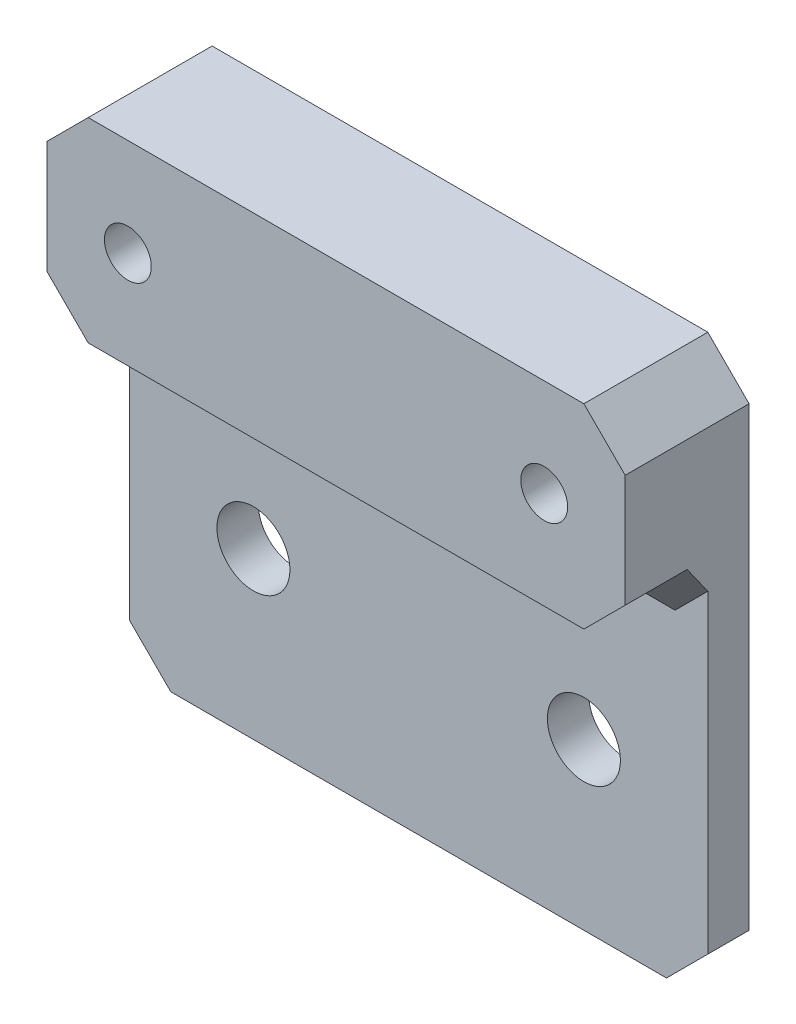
ISO-10303-21;
HEADER;
FILE_DESCRIPTION(('STEP AP214'),'2;1');
FILE_NAME('part.step','',(''),(''),'','','');
FILE_SCHEMA(('AUTOMOTIVE_DESIGN { 1 0 10303 214 1 1 1 1 }'));
ENDSEC;
DATA;
#1=APPLICATION_CONTEXT('core data for automotive mechanical design processes');
#2=APPLICATION_PROTOCOL_DEFINITION('international standard','automotive_design',2000,#1);
#3=PRODUCT_CONTEXT('',#1,'mechanical');
#4=PRODUCT('Part','Part','',(#3));
#5=PRODUCT_RELATED_PRODUCT_CATEGORY('part','',(#4));
#6=PRODUCT_DEFINITION_FORMATION('','',#4);
#7=PRODUCT_DEFINITION_CONTEXT('part definition',#1,'design');
#8=PRODUCT_DEFINITION('design','',#6,#7);
#9=PRODUCT_DEFINITION_SHAPE('','',#8);
#10=(LENGTH_UNIT() NAMED_UNIT(*) SI_UNIT(.MILLI.,.METRE.));
#11=(NAMED_UNIT(*) PLANE_ANGLE_UNIT() SI_UNIT($,.RADIAN.));
#12=(NAMED_UNIT(*) SI_UNIT($,.STERADIAN.) SOLID_ANGLE_UNIT());
#13=UNCERTAINTY_MEASURE_WITH_UNIT(LENGTH_MEASURE(1.E-05),#10,'distance_accuracy_value','');
#14=(GEOMETRIC_REPRESENTATION_CONTEXT(3) GLOBAL_UNCERTAINTY_ASSIGNED_CONTEXT((#13)) GLOBAL_UNIT_ASSIGNED_CONTEXT((#10,
#11,#12)) REPRESENTATION_CONTEXT('',''));
#15=CARTESIAN_POINT('',(0.,0.,0.));
#16=DIRECTION('',(0.,0.,1.));
#17=DIRECTION('',(1.,0.,0.));
#18=AXIS2_PLACEMENT_3D('',#15,#16,#17);
#19=CARTESIAN_POINT('',(22.225,28.7,3.175));
#20=DIRECTION('',(-1.,0.,0.));
#21=DIRECTION('',(0.,-1.,0.));
#22=AXIS2_PLACEMENT_3D('',#19,#20,#21);
#23=PLANE('',#22);
#24=DIRECTION('',(0.,1.,0.));
#25=VECTOR('',#24,1.);
#26=CARTESIAN_POINT('',(22.225,28.7,9.525));
#27=LINE('',#26,#25);
#28=CARTESIAN_POINT('',(22.225,16.875,9.525));
#29=VERTEX_POINT('',#28);
#30=CARTESIAN_POINT('',(22.225,25.525,9.525));
#31=VERTEX_POINT('',#30);
#32=EDGE_CURVE('E172',#29,#31,#27,.T.);
#33=ORIENTED_EDGE('',*,*,#32,.F.);
#34=DIRECTION('',(0.,0.,-1.));
#35=VECTOR('',#34,1.);
#36=CARTESIAN_POINT('',(22.225,16.875,3.175));
#37=LINE('',#36,#35);
#38=CARTESIAN_POINT('',(22.225,16.875,4.76250000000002));
#39=VERTEX_POINT('',#38);
#40=EDGE_CURVE('E182',#29,#39,#37,.T.);
#41=ORIENTED_EDGE('',*,*,#40,.T.);
#42=DIRECTION('',(0.,-0.816496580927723,-0.57735026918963));
#43=VECTOR('',#42,1.);
#44=CARTESIAN_POINT('',(22.225,24.0099786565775,9.80769179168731));
#45=LINE('',#44,#43);
#46=CARTESIAN_POINT('',(22.225,14.6299359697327,3.175));
#47=VERTEX_POINT('',#46);
#48=EDGE_CURVE('E44',#39,#47,#45,.T.);
#49=ORIENTED_EDGE('',*,*,#48,.T.);
#50=DIRECTION('',(0.,1.,0.));
#51=VECTOR('',#50,1.);
#52=CARTESIAN_POINT('',(22.225,12.7,3.175));
#53=LINE('',#52,#51);
#54=CARTESIAN_POINT('',(22.225,-9.525,3.175));
#55=VERTEX_POINT('',#54);
#56=EDGE_CURVE('E158',#55,#47,#53,.T.);
#57=ORIENTED_EDGE('',*,*,#56,.F.);
#58=DIRECTION('',(0.,0.,-1.));
#59=VECTOR('',#58,1.);
#60=CARTESIAN_POINT('',(22.225,-9.525,3.175));
#61=LINE('',#60,#59);
#62=CARTESIAN_POINT('',(22.225,-9.525,0.));
#63=VERTEX_POINT('',#62);
#64=EDGE_CURVE('E142',#55,#63,#61,.T.);
#65=ORIENTED_EDGE('',*,*,#64,.T.);
#66=DIRECTION('',(0.,1.,0.));
#67=VECTOR('',#66,1.);
#68=CARTESIAN_POINT('',(22.225,28.7,0.));
#69=LINE('',#68,#67);
#70=CARTESIAN_POINT('',(22.225,25.525,0.));
#71=VERTEX_POINT('',#70);
#72=EDGE_CURVE('E155',#63,#71,#69,.T.);
#73=ORIENTED_EDGE('',*,*,#72,.T.);
#74=DIRECTION('',(0.,0.,1.));
#75=VECTOR('',#74,1.);
#76=CARTESIAN_POINT('',(22.225,25.525,3.175));
#77=LINE('',#76,#75);
#78=EDGE_CURVE('E159',#71,#31,#77,.T.);
#79=ORIENTED_EDGE('',*,*,#78,.T.);
#80=EDGE_LOOP('',(#33,#41,#49,#57,#65,#73,#79));
#81=FACE_BOUND('',#80,.T.);
#82=ADVANCED_FACE('F35',(#81),#23,.F.);
#83=CARTESIAN_POINT('',(-22.225,28.7,3.175));
#84=DIRECTION('',(0.,-1.,0.));
#85=DIRECTION('',(0.,0.,-1.));
#86=AXIS2_PLACEMENT_3D('',#83,#84,#85);
#87=PLANE('',#86);
#88=DIRECTION('',(-1.,0.,0.));
#89=VECTOR('',#88,1.);
#90=CARTESIAN_POINT('',(-22.225,28.7,0.));
#91=LINE('',#90,#89);
#92=CARTESIAN_POINT('',(19.05,28.7,0.));
#93=VERTEX_POINT('',#92);
#94=CARTESIAN_POINT('',(-19.05,28.7,0.));
#95=VERTEX_POINT('',#94);
#96=EDGE_CURVE('E165',#93,#95,#91,.T.);
#97=ORIENTED_EDGE('',*,*,#96,.T.);
#98=DIRECTION('',(0.,0.,1.));
#99=VECTOR('',#98,1.);
#100=CARTESIAN_POINT('',(-19.05,28.7,3.175));
#101=LINE('',#100,#99);
#102=CARTESIAN_POINT('',(-19.05,28.7,9.525));
#103=VERTEX_POINT('',#102);
#104=EDGE_CURVE('E212',#95,#103,#101,.T.);
#105=ORIENTED_EDGE('',*,*,#104,.T.);
#106=DIRECTION('',(-1.,0.,0.));
#107=VECTOR('',#106,1.);
#108=CARTESIAN_POINT('',(-22.225,28.7,9.525));
#109=LINE('',#108,#107);
#110=CARTESIAN_POINT('',(19.05,28.7,9.525));
#111=VERTEX_POINT('',#110);
#112=EDGE_CURVE('E166',#111,#103,#109,.T.);
#113=ORIENTED_EDGE('',*,*,#112,.F.);
#114=DIRECTION('',(0.,0.,-1.));
#115=VECTOR('',#114,1.);
#116=CARTESIAN_POINT('',(19.05,28.7,3.175));
#117=LINE('',#116,#115);
#118=EDGE_CURVE('E209',#111,#93,#117,.T.);
#119=ORIENTED_EDGE('',*,*,#118,.T.);
#120=EDGE_LOOP('',(#97,#105,#113,#119));
#121=FACE_BOUND('',#120,.T.);
#122=ADVANCED_FACE('F305',(#121),#87,.F.);
#123=CARTESIAN_POINT('',(-22.225,12.7,3.175));
#124=DIRECTION('',(1.,0.,0.));
#125=DIRECTION('',(0.,1.,0.));
#126=AXIS2_PLACEMENT_3D('',#123,#124,#125);
#127=PLANE('',#126);
#128=DIRECTION('',(0.,-1.,0.));
#129=VECTOR('',#128,1.);
#130=CARTESIAN_POINT('',(-22.225,13.7,3.175));
#131=LINE('',#130,#129);
#132=CARTESIAN_POINT('',(-22.225,14.6299359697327,3.175));
#133=VERTEX_POINT('',#132);
#134=CARTESIAN_POINT('',(-22.225,-9.525,3.175));
#135=VERTEX_POINT('',#134);
#136=EDGE_CURVE('E285',#133,#135,#131,.T.);
#137=ORIENTED_EDGE('',*,*,#136,.F.);
#138=DIRECTION('',(0.,0.816496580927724,0.577350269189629));
#139=VECTOR('',#138,1.);
#140=CARTESIAN_POINT('',(-22.225,13.3433119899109,2.26521945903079));
#141=LINE('',#140,#139);
#142=CARTESIAN_POINT('',(-22.225,16.875,4.76250000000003));
#143=VERTEX_POINT('',#142);
#144=EDGE_CURVE('E11',#133,#143,#141,.T.);
#145=ORIENTED_EDGE('',*,*,#144,.T.);
#146=DIRECTION('',(0.,0.,1.));
#147=VECTOR('',#146,1.);
#148=CARTESIAN_POINT('',(-22.225,16.875,3.175));
#149=LINE('',#148,#147);
#150=CARTESIAN_POINT('',(-22.225,16.875,9.525));
#151=VERTEX_POINT('',#150);
#152=EDGE_CURVE('E203',#143,#151,#149,.T.);
#153=ORIENTED_EDGE('',*,*,#152,.T.);
#154=DIRECTION('',(0.,-1.,0.));
#155=VECTOR('',#154,1.);
#156=CARTESIAN_POINT('',(-22.225,28.7,9.525));
#157=LINE('',#156,#155);
#158=CARTESIAN_POINT('',(-22.225,25.525,9.525));
#159=VERTEX_POINT('',#158);
#160=EDGE_CURVE('E277',#159,#151,#157,.T.);
#161=ORIENTED_EDGE('',*,*,#160,.F.);
#162=DIRECTION('',(0.,0.,-1.));
#163=VECTOR('',#162,1.);
#164=CARTESIAN_POINT('',(-22.225,25.525,3.175));
#165=LINE('',#164,#163);
#166=CARTESIAN_POINT('',(-22.225,25.525,0.));
#167=VERTEX_POINT('',#166);
#168=EDGE_CURVE('E200',#159,#167,#165,.T.);
#169=ORIENTED_EDGE('',*,*,#168,.T.);
#170=DIRECTION('',(0.,-1.,0.));
#171=VECTOR('',#170,1.);
#172=CARTESIAN_POINT('',(-22.225,12.7,0.));
#173=LINE('',#172,#171);
#174=CARTESIAN_POINT('',(-22.225,-9.525,0.));
#175=VERTEX_POINT('',#174);
#176=EDGE_CURVE('E169',#167,#175,#173,.T.);
#177=ORIENTED_EDGE('',*,*,#176,.T.);
#178=DIRECTION('',(0.,0.,1.));
#179=VECTOR('',#178,1.);
#180=CARTESIAN_POINT('',(-22.225,-9.525,3.175));
#181=LINE('',#180,#179);
#182=EDGE_CURVE('E197',#175,#135,#181,.T.);
#183=ORIENTED_EDGE('',*,*,#182,.T.);
#184=EDGE_LOOP('',(#137,#145,#153,#161,#169,#177,#183));
#185=FACE_BOUND('',#184,.T.);
#186=ADVANCED_FACE('F297',(#185),#127,.F.);
#187=CARTESIAN_POINT('',(-22.225,-12.7,3.175));
#188=DIRECTION('',(0.,1.,0.));
#189=DIRECTION('',(0.,0.,1.));
#190=AXIS2_PLACEMENT_3D('',#187,#188,#189);
#191=PLANE('',#190);
#192=DIRECTION('',(1.,0.,0.));
#193=VECTOR('',#192,1.);
#194=CARTESIAN_POINT('',(-22.225,-12.7,0.));
#195=LINE('',#194,#193);
#196=CARTESIAN_POINT('',(-19.05,-12.7,0.));
#197=VERTEX_POINT('',#196);
#198=CARTESIAN_POINT('',(19.05,-12.7,0.));
#199=VERTEX_POINT('',#198);
#200=EDGE_CURVE('E179',#197,#199,#195,.T.);
#201=ORIENTED_EDGE('',*,*,#200,.T.);
#202=DIRECTION('',(0.,0.,1.));
#203=VECTOR('',#202,1.);
#204=CARTESIAN_POINT('',(19.05,-12.7,3.175));
#205=LINE('',#204,#203);
#206=CARTESIAN_POINT('',(19.05,-12.7,3.175));
#207=VERTEX_POINT('',#206);
#208=EDGE_CURVE('E143',#199,#207,#205,.T.);
#209=ORIENTED_EDGE('',*,*,#208,.T.);
#210=DIRECTION('',(1.,0.,0.));
#211=VECTOR('',#210,1.);
#212=CARTESIAN_POINT('',(-22.225,-12.7,3.175));
#213=LINE('',#212,#211);
#214=CARTESIAN_POINT('',(-19.05,-12.7,3.175));
#215=VERTEX_POINT('',#214);
#216=EDGE_CURVE('E160',#215,#207,#213,.T.);
#217=ORIENTED_EDGE('',*,*,#216,.F.);
#218=DIRECTION('',(0.,0.,-1.));
#219=VECTOR('',#218,1.);
#220=CARTESIAN_POINT('',(-19.05,-12.7,3.175));
#221=LINE('',#220,#219);
#222=EDGE_CURVE('E214',#215,#197,#221,.T.);
#223=ORIENTED_EDGE('',*,*,#222,.T.);
#224=EDGE_LOOP('',(#201,#209,#217,#223));
#225=FACE_BOUND('',#224,.T.);
#226=ADVANCED_FACE('F293',(#225),#191,.F.);
#227=CARTESIAN_POINT('',(0.,0.,3.175));
#228=DIRECTION('',(0.,0.,1.));
#229=DIRECTION('',(1.,0.,0.));
#230=AXIS2_PLACEMENT_3D('',#227,#228,#229);
#231=PLANE('',#230);
#232=CARTESIAN_POINT('',(-12.7,0.,3.175));
#233=DIRECTION('',(0.,0.,1.));
#234=DIRECTION('',(1.,0.,0.));
#235=AXIS2_PLACEMENT_3D('',#232,#233,#234);
#236=CIRCLE('',#235,2.8067);
#237=CARTESIAN_POINT('',(-9.89330000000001,0.,3.175));
#238=VERTEX_POINT('',#237);
#239=EDGE_CURVE('E399',#238,#238,#236,.T.);
#240=ORIENTED_EDGE('',*,*,#239,.F.);
#241=EDGE_LOOP('',(#240));
#242=FACE_BOUND('',#241,.T.);
#243=CARTESIAN_POINT('',(12.7,0.,3.175));
#244=DIRECTION('',(0.,0.,1.));
#245=DIRECTION('',(1.,0.,0.));
#246=AXIS2_PLACEMENT_3D('',#243,#244,#245);
#247=CIRCLE('',#246,2.8067);
#248=CARTESIAN_POINT('',(15.5067,0.,3.175));
#249=VERTEX_POINT('',#248);
#250=EDGE_CURVE('E244',#249,#249,#247,.T.);
#251=ORIENTED_EDGE('',*,*,#250,.F.);
#252=EDGE_LOOP('',(#251));
#253=FACE_BOUND('',#252,.T.);
#254=ORIENTED_EDGE('',*,*,#56,.T.);
#255=DIRECTION('',(-0.707106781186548,-0.707106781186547,0.));
#256=VECTOR('',#255,1.);
#257=CARTESIAN_POINT('',(20.1725320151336,12.5774679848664,3.175));
#258=LINE('',#257,#256);
#259=CARTESIAN_POINT('',(19.7075640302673,12.1125,3.175));
#260=VERTEX_POINT('',#259);
#261=EDGE_CURVE('E226',#47,#260,#258,.T.);
#262=ORIENTED_EDGE('',*,*,#261,.T.);
#263=DIRECTION('',(-1.,0.,0.));
#264=VECTOR('',#263,1.);
#265=CARTESIAN_POINT('',(0.,12.1125,3.175));
#266=LINE('',#265,#264);
#267=CARTESIAN_POINT('',(-19.7075640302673,12.1125,3.175));
#268=VERTEX_POINT('',#267);
#269=EDGE_CURVE('E222',#260,#268,#266,.T.);
#270=ORIENTED_EDGE('',*,*,#269,.T.);
#271=DIRECTION('',(-0.707106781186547,0.707106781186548,0.));
#272=VECTOR('',#271,1.);
#273=CARTESIAN_POINT('',(-23.3475320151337,15.7524679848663,3.175));
#274=LINE('',#273,#272);
#275=EDGE_CURVE('E224',#268,#133,#274,.T.);
#276=ORIENTED_EDGE('',*,*,#275,.T.);
#277=ORIENTED_EDGE('',*,*,#136,.T.);
#278=DIRECTION('',(-0.707106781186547,0.707106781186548,0.));
#279=VECTOR('',#278,1.);
#280=CARTESIAN_POINT('',(-15.875,-15.875,3.175));
#281=LINE('',#280,#279);
#282=EDGE_CURVE('E218',#135,#215,#281,.F.);
#283=ORIENTED_EDGE('',*,*,#282,.T.);
#284=ORIENTED_EDGE('',*,*,#216,.T.);
#285=DIRECTION('',(-0.707106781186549,-0.707106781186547,0.));
#286=VECTOR('',#285,1.);
#287=CARTESIAN_POINT('',(15.875,-15.875,3.175));
#288=LINE('',#287,#286);
#289=EDGE_CURVE('E220',#207,#55,#288,.F.);
#290=ORIENTED_EDGE('',*,*,#289,.T.);
#291=EDGE_LOOP('',(#254,#262,#270,#276,#277,#283,#284,#290));
#292=FACE_BOUND('',#291,.T.);
#293=ADVANCED_FACE('F289',(#242,#253,#292),#231,.T.);
#294=CARTESIAN_POINT('',(0.,0.,0.));
#295=DIRECTION('',(0.,0.,1.));
#296=DIRECTION('',(1.,0.,0.));
#297=AXIS2_PLACEMENT_3D('',#294,#295,#296);
#298=PLANE('',#297);
#299=CARTESIAN_POINT('',(-12.7,0.,0.));
#300=DIRECTION('',(0.,0.,1.));
#301=DIRECTION('',(1.,0.,0.));
#302=AXIS2_PLACEMENT_3D('',#299,#300,#301);
#303=CIRCLE('',#302,2.8067);
#304=CARTESIAN_POINT('',(-9.89330000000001,0.,0.));
#305=VERTEX_POINT('',#304);
#306=EDGE_CURVE('E249',#305,#305,#303,.T.);
#307=ORIENTED_EDGE('',*,*,#306,.T.);
#308=EDGE_LOOP('',(#307));
#309=FACE_BOUND('',#308,.T.);
#310=CARTESIAN_POINT('',(12.7,0.,0.));
#311=DIRECTION('',(0.,0.,1.));
#312=DIRECTION('',(1.,0.,0.));
#313=AXIS2_PLACEMENT_3D('',#310,#311,#312);
#314=CIRCLE('',#313,2.8067);
#315=CARTESIAN_POINT('',(15.5067,0.,0.));
#316=VERTEX_POINT('',#315);
#317=EDGE_CURVE('E235',#316,#316,#314,.T.);
#318=ORIENTED_EDGE('',*,*,#317,.T.);
#319=EDGE_LOOP('',(#318));
#320=FACE_BOUND('',#319,.T.);
#321=CARTESIAN_POINT('',(16.,21.2,0.));
#322=DIRECTION('',(0.,0.,-1.));
#323=DIRECTION('',(-1.,0.,0.));
#324=AXIS2_PLACEMENT_3D('',#321,#322,#323);
#325=CIRCLE('',#324,4.2);
#326=CARTESIAN_POINT('',(11.8,21.2,0.));
#327=VERTEX_POINT('',#326);
#328=EDGE_CURVE('E242',#327,#327,#325,.T.);
#329=ORIENTED_EDGE('',*,*,#328,.F.);
#330=EDGE_LOOP('',(#329));
#331=FACE_BOUND('',#330,.T.);
#332=CARTESIAN_POINT('',(-16.,21.2,0.));
#333=DIRECTION('',(0.,0.,-1.));
#334=DIRECTION('',(-1.,0.,0.));
#335=AXIS2_PLACEMENT_3D('',#332,#333,#334);
#336=CIRCLE('',#335,4.2);
#337=CARTESIAN_POINT('',(-20.2,21.2,0.));
#338=VERTEX_POINT('',#337);
#339=EDGE_CURVE('E264',#338,#338,#336,.T.);
#340=ORIENTED_EDGE('',*,*,#339,.F.);
#341=EDGE_LOOP('',(#340));
#342=FACE_BOUND('',#341,.T.);
#343=ORIENTED_EDGE('',*,*,#176,.F.);
#344=DIRECTION('',(-0.707106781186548,-0.707106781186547,0.));
#345=VECTOR('',#344,1.);
#346=CARTESIAN_POINT('',(-22.225,25.525,0.));
#347=LINE('',#346,#345);
#348=EDGE_CURVE('E207',#167,#95,#347,.F.);
#349=ORIENTED_EDGE('',*,*,#348,.T.);
#350=ORIENTED_EDGE('',*,*,#96,.F.);
#351=DIRECTION('',(-0.707106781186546,0.707106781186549,0.));
#352=VECTOR('',#351,1.);
#353=CARTESIAN_POINT('',(19.05,28.7,0.));
#354=LINE('',#353,#352);
#355=EDGE_CURVE('E148',#93,#71,#354,.F.);
#356=ORIENTED_EDGE('',*,*,#355,.T.);
#357=ORIENTED_EDGE('',*,*,#72,.F.);
#358=DIRECTION('',(0.707106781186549,0.707106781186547,0.));
#359=VECTOR('',#358,1.);
#360=CARTESIAN_POINT('',(22.225,-9.525,0.));
#361=LINE('',#360,#359);
#362=EDGE_CURVE('E138',#63,#199,#361,.F.);
#363=ORIENTED_EDGE('',*,*,#362,.T.);
#364=ORIENTED_EDGE('',*,*,#200,.F.);
#365=DIRECTION('',(0.707106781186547,-0.707106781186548,0.));
#366=VECTOR('',#365,1.);
#367=CARTESIAN_POINT('',(-19.05,-12.7,0.));
#368=LINE('',#367,#366);
#369=EDGE_CURVE('E149',#197,#175,#368,.F.);
#370=ORIENTED_EDGE('',*,*,#369,.T.);
#371=EDGE_LOOP('',(#343,#349,#350,#356,#357,#363,#364,#370));
#372=FACE_BOUND('',#371,.T.);
#373=ADVANCED_FACE('F163',(#309,#320,#331,#342,#372),#298,.F.);
#374=CARTESIAN_POINT('',(-22.225,13.7,9.525));
#375=DIRECTION('',(0.,1.,0.));
#376=DIRECTION('',(0.,0.,1.));
#377=AXIS2_PLACEMENT_3D('',#374,#375,#376);
#378=PLANE('',#377);
#379=DIRECTION('',(0.,0.,-1.));
#380=VECTOR('',#379,1.);
#381=CARTESIAN_POINT('',(-19.05,13.7,9.525));
#382=LINE('',#381,#380);
#383=CARTESIAN_POINT('',(-19.05,13.7,9.525));
#384=VERTEX_POINT('',#383);
#385=CARTESIAN_POINT('',(-19.05,13.7,4.76250000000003));
#386=VERTEX_POINT('',#385);
#387=EDGE_CURVE('E185',#384,#386,#382,.T.);
#388=ORIENTED_EDGE('',*,*,#387,.T.);
#389=DIRECTION('',(1.,0.,0.));
#390=VECTOR('',#389,1.);
#391=CARTESIAN_POINT('',(-22.225,13.7,4.76250000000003));
#392=LINE('',#391,#390);
#393=CARTESIAN_POINT('',(19.05,13.7,4.76250000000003));
#394=VERTEX_POINT('',#393);
#395=EDGE_CURVE('E232',#386,#394,#392,.T.);
#396=ORIENTED_EDGE('',*,*,#395,.T.);
#397=DIRECTION('',(0.,0.,1.));
#398=VECTOR('',#397,1.);
#399=CARTESIAN_POINT('',(19.05,13.7,9.525));
#400=LINE('',#399,#398);
#401=CARTESIAN_POINT('',(19.05,13.7,9.525));
#402=VERTEX_POINT('',#401);
#403=EDGE_CURVE('E187',#394,#402,#400,.T.);
#404=ORIENTED_EDGE('',*,*,#403,.T.);
#405=DIRECTION('',(1.,0.,0.));
#406=VECTOR('',#405,1.);
#407=CARTESIAN_POINT('',(-22.225,13.7,9.525));
#408=LINE('',#407,#406);
#409=EDGE_CURVE('E280',#384,#402,#408,.T.);
#410=ORIENTED_EDGE('',*,*,#409,.F.);
#411=EDGE_LOOP('',(#388,#396,#404,#410));
#412=FACE_BOUND('',#411,.T.);
#413=ADVANCED_FACE('F328',(#412),#378,.F.);
#414=CARTESIAN_POINT('',(0.,0.,9.525));
#415=DIRECTION('',(0.,0.,1.));
#416=DIRECTION('',(1.,0.,0.));
#417=AXIS2_PLACEMENT_3D('',#414,#415,#416);
#418=PLANE('',#417);
#419=CARTESIAN_POINT('',(16.,21.2,9.525));
#420=DIRECTION('',(0.,0.,-1.));
#421=DIRECTION('',(-1.,0.,0.));
#422=AXIS2_PLACEMENT_3D('',#419,#420,#421);
#423=CIRCLE('',#422,1.8);
#424=CARTESIAN_POINT('',(14.2,21.2,9.525));
#425=VERTEX_POINT('',#424);
#426=EDGE_CURVE('E261',#425,#425,#423,.T.);
#427=ORIENTED_EDGE('',*,*,#426,.T.);
#428=EDGE_LOOP('',(#427));
#429=FACE_BOUND('',#428,.T.);
#430=CARTESIAN_POINT('',(-16.,21.2,9.525));
#431=DIRECTION('',(0.,0.,-1.));
#432=DIRECTION('',(-1.,0.,0.));
#433=AXIS2_PLACEMENT_3D('',#430,#431,#432);
#434=CIRCLE('',#433,1.8);
#435=CARTESIAN_POINT('',(-17.8,21.2,9.525));
#436=VERTEX_POINT('',#435);
#437=EDGE_CURVE('E274',#436,#436,#434,.T.);
#438=ORIENTED_EDGE('',*,*,#437,.T.);
#439=EDGE_LOOP('',(#438));
#440=FACE_BOUND('',#439,.T.);
#441=ORIENTED_EDGE('',*,*,#409,.T.);
#442=DIRECTION('',(-0.707106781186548,-0.707106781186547,0.));
#443=VECTOR('',#442,1.);
#444=CARTESIAN_POINT('',(2.67499999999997,-2.67499999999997,9.525));
#445=LINE('',#444,#443);
#446=EDGE_CURVE('E195',#402,#29,#445,.F.);
#447=ORIENTED_EDGE('',*,*,#446,.T.);
#448=ORIENTED_EDGE('',*,*,#32,.T.);
#449=DIRECTION('',(0.707106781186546,-0.707106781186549,0.));
#450=VECTOR('',#449,1.);
#451=CARTESIAN_POINT('',(23.875,23.8749999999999,9.525));
#452=LINE('',#451,#450);
#453=EDGE_CURVE('E189',#31,#111,#452,.F.);
#454=ORIENTED_EDGE('',*,*,#453,.T.);
#455=ORIENTED_EDGE('',*,*,#112,.T.);
#456=DIRECTION('',(0.707106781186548,0.707106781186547,0.));
#457=VECTOR('',#456,1.);
#458=CARTESIAN_POINT('',(-23.875,23.875,9.525));
#459=LINE('',#458,#457);
#460=EDGE_CURVE('E191',#103,#159,#459,.F.);
#461=ORIENTED_EDGE('',*,*,#460,.T.);
#462=ORIENTED_EDGE('',*,*,#160,.T.);
#463=DIRECTION('',(-0.707106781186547,0.707106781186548,0.));
#464=VECTOR('',#463,1.);
#465=CARTESIAN_POINT('',(-2.67500000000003,-2.67500000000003,9.525));
#466=LINE('',#465,#464);
#467=EDGE_CURVE('E193',#151,#384,#466,.F.);
#468=ORIENTED_EDGE('',*,*,#467,.T.);
#469=EDGE_LOOP('',(#441,#447,#448,#454,#455,#461,#462,#468));
#470=FACE_BOUND('',#469,.T.);
#471=ADVANCED_FACE('F313',(#429,#440,#470),#418,.T.);
#472=CARTESIAN_POINT('',(-16.,21.2,0.));
#473=DIRECTION('',(0.,0.,-1.));
#474=DIRECTION('',(-1.,0.,0.));
#475=AXIS2_PLACEMENT_3D('',#472,#473,#474);
#476=CYLINDRICAL_SURFACE('',#475,1.8);
#477=ORIENTED_EDGE('',*,*,#437,.F.);
#478=EDGE_LOOP('',(#477));
#479=FACE_BOUND('',#478,.T.);
#480=CARTESIAN_POINT('',(-16.,21.2,2.3));
#481=DIRECTION('',(0.,0.,-1.));
#482=DIRECTION('',(-1.,0.,0.));
#483=AXIS2_PLACEMENT_3D('',#480,#481,#482);
#484=CIRCLE('',#483,1.8);
#485=CARTESIAN_POINT('',(-17.8,21.2,2.3));
#486=VERTEX_POINT('',#485);
#487=EDGE_CURVE('E271',#486,#486,#484,.T.);
#488=ORIENTED_EDGE('',*,*,#487,.T.);
#489=EDGE_LOOP('',(#488));
#490=FACE_BOUND('',#489,.T.);
#491=ADVANCED_FACE('F361',(#479,#490),#476,.F.);
#492=CARTESIAN_POINT('',(-14.2,21.2,2.3));
#493=DIRECTION('',(0.,0.,1.));
#494=DIRECTION('',(1.,0.,0.));
#495=AXIS2_PLACEMENT_3D('',#492,#493,#494);
#496=PLANE('',#495);
#497=ORIENTED_EDGE('',*,*,#487,.F.);
#498=EDGE_LOOP('',(#497));
#499=FACE_BOUND('',#498,.T.);
#500=CARTESIAN_POINT('',(-16.,21.2,2.3));
#501=DIRECTION('',(0.,0.,-1.));
#502=DIRECTION('',(-1.,0.,0.));
#503=AXIS2_PLACEMENT_3D('',#500,#501,#502);
#504=CIRCLE('',#503,4.2);
#505=CARTESIAN_POINT('',(-20.2,21.2,2.3));
#506=VERTEX_POINT('',#505);
#507=EDGE_CURVE('E268',#506,#506,#504,.T.);
#508=ORIENTED_EDGE('',*,*,#507,.T.);
#509=EDGE_LOOP('',(#508));
#510=FACE_BOUND('',#509,.T.);
#511=ADVANCED_FACE('F365',(#499,#510),#496,.F.);
#512=CARTESIAN_POINT('',(-16.,21.2,0.));
#513=DIRECTION('',(0.,0.,-1.));
#514=DIRECTION('',(-1.,0.,0.));
#515=AXIS2_PLACEMENT_3D('',#512,#513,#514);
#516=CYLINDRICAL_SURFACE('',#515,4.2);
#517=ORIENTED_EDGE('',*,*,#507,.F.);
#518=EDGE_LOOP('',(#517));
#519=FACE_BOUND('',#518,.T.);
#520=ORIENTED_EDGE('',*,*,#339,.T.);
#521=EDGE_LOOP('',(#520));
#522=FACE_BOUND('',#521,.T.);
#523=ADVANCED_FACE('F369',(#519,#522),#516,.F.);
#524=CARTESIAN_POINT('',(16.,21.2,0.));
#525=DIRECTION('',(0.,0.,-1.));
#526=DIRECTION('',(-1.,0.,0.));
#527=AXIS2_PLACEMENT_3D('',#524,#525,#526);
#528=CYLINDRICAL_SURFACE('',#527,1.8);
#529=ORIENTED_EDGE('',*,*,#426,.F.);
#530=EDGE_LOOP('',(#529));
#531=FACE_BOUND('',#530,.T.);
#532=CARTESIAN_POINT('',(16.,21.2,2.3));
#533=DIRECTION('',(0.,0.,-1.));
#534=DIRECTION('',(-1.,0.,0.));
#535=AXIS2_PLACEMENT_3D('',#532,#533,#534);
#536=CIRCLE('',#535,1.8);
#537=CARTESIAN_POINT('',(14.2,21.2,2.3));
#538=VERTEX_POINT('',#537);
#539=EDGE_CURVE('E258',#538,#538,#536,.T.);
#540=ORIENTED_EDGE('',*,*,#539,.T.);
#541=EDGE_LOOP('',(#540));
#542=FACE_BOUND('',#541,.T.);
#543=ADVANCED_FACE('F373',(#531,#542),#528,.F.);
#544=CARTESIAN_POINT('',(17.8,21.2,2.3));
#545=DIRECTION('',(0.,0.,1.));
#546=DIRECTION('',(1.,0.,0.));
#547=AXIS2_PLACEMENT_3D('',#544,#545,#546);
#548=PLANE('',#547);
#549=ORIENTED_EDGE('',*,*,#539,.F.);
#550=EDGE_LOOP('',(#549));
#551=FACE_BOUND('',#550,.T.);
#552=CARTESIAN_POINT('',(16.,21.2,2.3));
#553=DIRECTION('',(0.,0.,-1.));
#554=DIRECTION('',(-1.,0.,0.));
#555=AXIS2_PLACEMENT_3D('',#552,#553,#554);
#556=CIRCLE('',#555,4.2);
#557=CARTESIAN_POINT('',(11.8,21.2,2.3));
#558=VERTEX_POINT('',#557);
#559=EDGE_CURVE('E255',#558,#558,#556,.T.);
#560=ORIENTED_EDGE('',*,*,#559,.T.);
#561=EDGE_LOOP('',(#560));
#562=FACE_BOUND('',#561,.T.);
#563=ADVANCED_FACE('F377',(#551,#562),#548,.F.);
#564=CARTESIAN_POINT('',(16.,21.2,0.));
#565=DIRECTION('',(0.,0.,-1.));
#566=DIRECTION('',(-1.,0.,0.));
#567=AXIS2_PLACEMENT_3D('',#564,#565,#566);
#568=CYLINDRICAL_SURFACE('',#567,4.2);
#569=ORIENTED_EDGE('',*,*,#559,.F.);
#570=EDGE_LOOP('',(#569));
#571=FACE_BOUND('',#570,.T.);
#572=ORIENTED_EDGE('',*,*,#328,.T.);
#573=EDGE_LOOP('',(#572));
#574=FACE_BOUND('',#573,.T.);
#575=ADVANCED_FACE('F338',(#571,#574),#568,.F.);
#576=CARTESIAN_POINT('',(22.225,16.875,3.175));
#577=DIRECTION('',(-0.707106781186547,0.707106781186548,0.));
#578=DIRECTION('',(0.,0.,-1.));
#579=AXIS2_PLACEMENT_3D('',#576,#577,#578);
#580=PLANE('',#579);
#581=ORIENTED_EDGE('',*,*,#403,.F.);
#582=DIRECTION('',(-0.707106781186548,-0.707106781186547,0.));
#583=VECTOR('',#582,1.);
#584=CARTESIAN_POINT('',(22.225,16.875,4.76250000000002));
#585=LINE('',#584,#583);
#586=EDGE_CURVE('E229',#394,#39,#585,.F.);
#587=ORIENTED_EDGE('',*,*,#586,.T.);
#588=ORIENTED_EDGE('',*,*,#40,.F.);
#589=ORIENTED_EDGE('',*,*,#446,.F.);
#590=EDGE_LOOP('',(#581,#587,#588,#589));
#591=FACE_BOUND('',#590,.T.);
#592=ADVANCED_FACE('F318',(#591),#580,.F.);
#593=CARTESIAN_POINT('',(-19.05,13.7,9.525));
#594=DIRECTION('',(0.707106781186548,0.707106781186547,0.));
#595=DIRECTION('',(0.,0.,-1.));
#596=AXIS2_PLACEMENT_3D('',#593,#594,#595);
#597=PLANE('',#596);
#598=ORIENTED_EDGE('',*,*,#152,.F.);
#599=DIRECTION('',(-0.707106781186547,0.707106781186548,0.));
#600=VECTOR('',#599,1.);
#601=CARTESIAN_POINT('',(-19.05,13.7,4.76250000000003));
#602=LINE('',#601,#600);
#603=EDGE_CURVE('E52',#143,#386,#602,.F.);
#604=ORIENTED_EDGE('',*,*,#603,.T.);
#605=ORIENTED_EDGE('',*,*,#387,.F.);
#606=ORIENTED_EDGE('',*,*,#467,.F.);
#607=EDGE_LOOP('',(#598,#604,#605,#606));
#608=FACE_BOUND('',#607,.T.);
#609=ADVANCED_FACE('F330',(#608),#597,.F.);
#610=CARTESIAN_POINT('',(-22.225,25.525,3.175));
#611=DIRECTION('',(0.707106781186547,-0.707106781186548,0.));
#612=DIRECTION('',(0.,0.,-1.));
#613=AXIS2_PLACEMENT_3D('',#610,#611,#612);
#614=PLANE('',#613);
#615=ORIENTED_EDGE('',*,*,#460,.F.);
#616=ORIENTED_EDGE('',*,*,#104,.F.);
#617=ORIENTED_EDGE('',*,*,#348,.F.);
#618=ORIENTED_EDGE('',*,*,#168,.F.);
#619=EDGE_LOOP('',(#615,#616,#617,#618));
#620=FACE_BOUND('',#619,.T.);
#621=ADVANCED_FACE('F302',(#620),#614,.F.);
#622=CARTESIAN_POINT('',(19.05,28.7,3.175));
#623=DIRECTION('',(-0.707106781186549,-0.707106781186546,0.));
#624=DIRECTION('',(0.,0.,-1.));
#625=AXIS2_PLACEMENT_3D('',#622,#623,#624);
#626=PLANE('',#625);
#627=ORIENTED_EDGE('',*,*,#453,.F.);
#628=ORIENTED_EDGE('',*,*,#78,.F.);
#629=ORIENTED_EDGE('',*,*,#355,.F.);
#630=ORIENTED_EDGE('',*,*,#118,.F.);
#631=EDGE_LOOP('',(#627,#628,#629,#630));
#632=FACE_BOUND('',#631,.T.);
#633=ADVANCED_FACE('F310',(#632),#626,.F.);
#634=CARTESIAN_POINT('',(22.225,-9.525,3.175));
#635=DIRECTION('',(-0.707106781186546,0.707106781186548,0.));
#636=DIRECTION('',(0.,0.,-1.));
#637=AXIS2_PLACEMENT_3D('',#634,#635,#636);
#638=PLANE('',#637);
#639=ORIENTED_EDGE('',*,*,#289,.F.);
#640=ORIENTED_EDGE('',*,*,#208,.F.);
#641=ORIENTED_EDGE('',*,*,#362,.F.);
#642=ORIENTED_EDGE('',*,*,#64,.F.);
#643=EDGE_LOOP('',(#639,#640,#641,#642));
#644=FACE_BOUND('',#643,.T.);
#645=ADVANCED_FACE('F141',(#644),#638,.F.);
#646=CARTESIAN_POINT('',(-19.05,-12.7,3.175));
#647=DIRECTION('',(0.707106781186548,0.707106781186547,0.));
#648=DIRECTION('',(0.,0.,-1.));
#649=AXIS2_PLACEMENT_3D('',#646,#647,#648);
#650=PLANE('',#649);
#651=ORIENTED_EDGE('',*,*,#282,.F.);
#652=ORIENTED_EDGE('',*,*,#182,.F.);
#653=ORIENTED_EDGE('',*,*,#369,.F.);
#654=ORIENTED_EDGE('',*,*,#222,.F.);
#655=EDGE_LOOP('',(#651,#652,#653,#654));
#656=FACE_BOUND('',#655,.T.);
#657=ADVANCED_FACE('F295',(#656),#650,.F.);
#658=CARTESIAN_POINT('',(-3.79753201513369,-3.79753201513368,3.175));
#659=DIRECTION('',(0.500000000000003,0.500000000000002,-0.707106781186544));
#660=DIRECTION('',(-0.707106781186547,0.707106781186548,0.));
#661=AXIS2_PLACEMENT_3D('',#658,#659,#660);
#662=PLANE('',#661);
#663=ORIENTED_EDGE('',*,*,#144,.F.);
#664=ORIENTED_EDGE('',*,*,#275,.F.);
#665=DIRECTION('',(-0.281084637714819,-0.678598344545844,-0.67859834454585));
#666=VECTOR('',#665,1.);
#667=CARTESIAN_POINT('',(-19.3008522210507,13.094389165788,4.15688916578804));
#668=LINE('',#667,#666);
#669=EDGE_CURVE('E39',#386,#268,#668,.T.);
#670=ORIENTED_EDGE('',*,*,#669,.F.);
#671=ORIENTED_EDGE('',*,*,#603,.F.);
#672=EDGE_LOOP('',(#663,#664,#670,#671));
#673=FACE_BOUND('',#672,.T.);
#674=ADVANCED_FACE('F37',(#673),#662,.F.);
#675=CARTESIAN_POINT('',(-22.225,13.7,4.76250000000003));
#676=DIRECTION('',(0.,0.707106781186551,-0.707106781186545));
#677=DIRECTION('',(1.,0.,0.));
#678=AXIS2_PLACEMENT_3D('',#675,#676,#677);
#679=PLANE('',#678);
#680=ORIENTED_EDGE('',*,*,#669,.T.);
#681=ORIENTED_EDGE('',*,*,#269,.F.);
#682=DIRECTION('',(-0.281084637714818,0.678598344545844,0.678598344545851));
#683=VECTOR('',#682,1.);
#684=CARTESIAN_POINT('',(15.7889211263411,21.5729408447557,12.6354408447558));
#685=LINE('',#684,#683);
#686=EDGE_CURVE('E234',#394,#260,#685,.F.);
#687=ORIENTED_EDGE('',*,*,#686,.F.);
#688=ORIENTED_EDGE('',*,*,#395,.F.);
#689=EDGE_LOOP('',(#680,#681,#687,#688));
#690=FACE_BOUND('',#689,.T.);
#691=ADVANCED_FACE('F326',(#690),#679,.F.);
#692=CARTESIAN_POINT('',(3.79753201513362,-3.79753201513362,3.175));
#693=DIRECTION('',(-0.500000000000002,0.500000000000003,-0.707106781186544));
#694=DIRECTION('',(-0.707106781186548,-0.707106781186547,0.));
#695=AXIS2_PLACEMENT_3D('',#692,#693,#694);
#696=PLANE('',#695);
#697=ORIENTED_EDGE('',*,*,#48,.F.);
#698=ORIENTED_EDGE('',*,*,#586,.F.);
#699=ORIENTED_EDGE('',*,*,#686,.T.);
#700=ORIENTED_EDGE('',*,*,#261,.F.);
#701=EDGE_LOOP('',(#697,#698,#699,#700));
#702=FACE_BOUND('',#701,.T.);
#703=ADVANCED_FACE('F320',(#702),#696,.F.);
#704=CARTESIAN_POINT('',(12.7,0.,3.175));
#705=DIRECTION('',(0.,0.,1.));
#706=DIRECTION('',(1.,0.,0.));
#707=AXIS2_PLACEMENT_3D('',#704,#705,#706);
#708=CYLINDRICAL_SURFACE('',#707,2.8067);
#709=ORIENTED_EDGE('',*,*,#317,.F.);
#710=EDGE_LOOP('',(#709));
#711=FACE_BOUND('',#710,.T.);
#712=ORIENTED_EDGE('',*,*,#250,.T.);
#713=EDGE_LOOP('',(#712));
#714=FACE_BOUND('',#713,.T.);
#715=ADVANCED_FACE('F385',(#711,#714),#708,.F.);
#716=CARTESIAN_POINT('',(-12.7,0.,3.175));
#717=DIRECTION('',(0.,0.,1.));
#718=DIRECTION('',(1.,0.,0.));
#719=AXIS2_PLACEMENT_3D('',#716,#717,#718);
#720=CYLINDRICAL_SURFACE('',#719,2.8067);
#721=ORIENTED_EDGE('',*,*,#306,.F.);
#722=EDGE_LOOP('',(#721));
#723=FACE_BOUND('',#722,.T.);
#724=ORIENTED_EDGE('',*,*,#239,.T.);
#725=EDGE_LOOP('',(#724));
#726=FACE_BOUND('',#725,.T.);
#727=ADVANCED_FACE('F388',(#723,#726),#720,.F.);
#728=CLOSED_SHELL('',(#82,#122,#186,#226,#293,#373,#413,#471,#491,#511,#523,#543,#563,#575,#592,
#609,#621,#633,#645,#657,#674,#691,#703,#715,#727));
#729=MANIFOLD_SOLID_BREP('B2',#728);
#730=ADVANCED_BREP_SHAPE_REPRESENTATION('',(#18,#729),#14);
#731=SHAPE_DEFINITION_REPRESENTATION(#9,#730);
ENDSEC;
END-ISO-10303-21;
